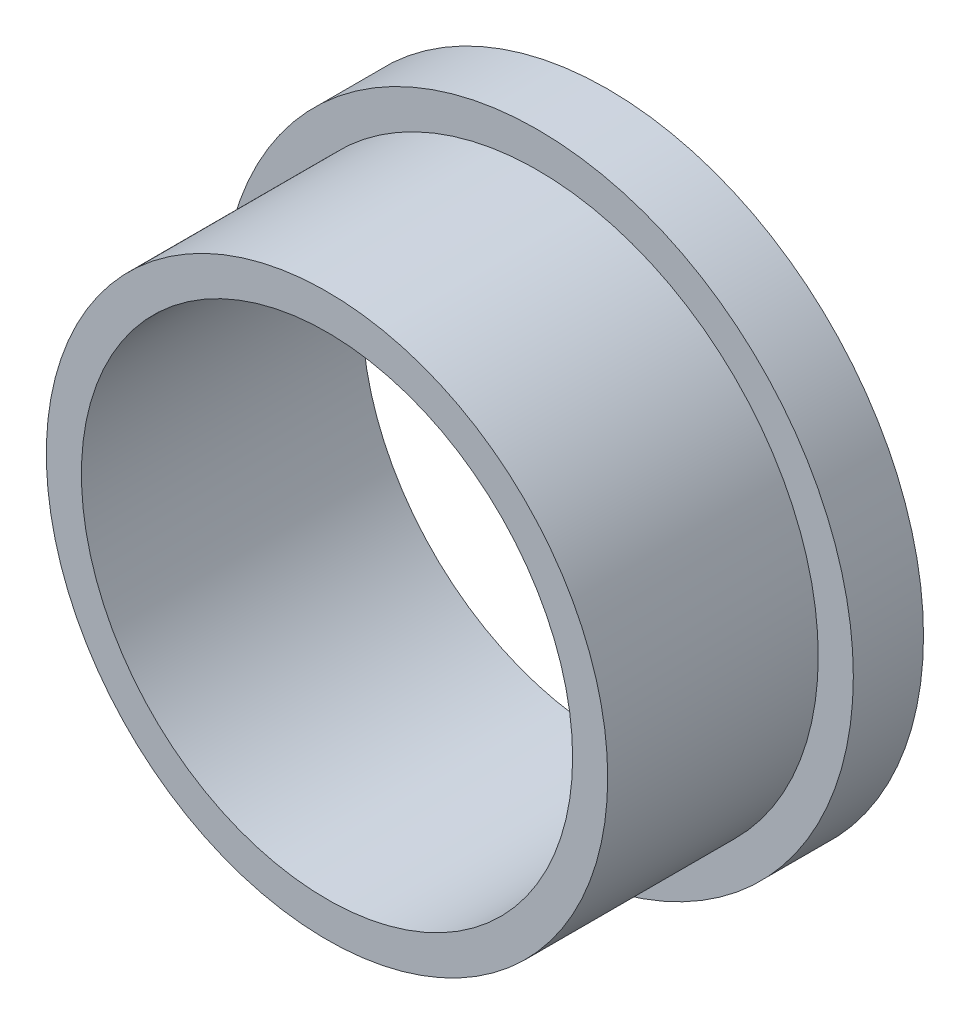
ISO-10303-21;
HEADER;
FILE_DESCRIPTION(('STEP AP214'),'2;1');
FILE_NAME('part.step','',(''),(''),'','','');
FILE_SCHEMA(('AUTOMOTIVE_DESIGN { 1 0 10303 214 1 1 1 1 }'));
ENDSEC;
DATA;
#1=APPLICATION_CONTEXT('core data for automotive mechanical design processes');
#2=APPLICATION_PROTOCOL_DEFINITION('international standard','automotive_design',2000,#1);
#3=PRODUCT_CONTEXT('',#1,'mechanical');
#4=PRODUCT('Part','Part','',(#3));
#5=PRODUCT_RELATED_PRODUCT_CATEGORY('part','',(#4));
#6=PRODUCT_DEFINITION_FORMATION('','',#4);
#7=PRODUCT_DEFINITION_CONTEXT('part definition',#1,'design');
#8=PRODUCT_DEFINITION('design','',#6,#7);
#9=PRODUCT_DEFINITION_SHAPE('','',#8);
#10=(LENGTH_UNIT() NAMED_UNIT(*) SI_UNIT(.MILLI.,.METRE.));
#11=(NAMED_UNIT(*) PLANE_ANGLE_UNIT() SI_UNIT($,.RADIAN.));
#12=(NAMED_UNIT(*) SI_UNIT($,.STERADIAN.) SOLID_ANGLE_UNIT());
#13=UNCERTAINTY_MEASURE_WITH_UNIT(LENGTH_MEASURE(1.E-05),#10,'distance_accuracy_value','');
#14=(GEOMETRIC_REPRESENTATION_CONTEXT(3) GLOBAL_UNCERTAINTY_ASSIGNED_CONTEXT((#13)) GLOBAL_UNIT_ASSIGNED_CONTEXT((#10,
#11,#12)) REPRESENTATION_CONTEXT('',''));
#15=CARTESIAN_POINT('',(0.,0.,0.));
#16=DIRECTION('',(0.,0.,1.));
#17=DIRECTION('',(1.,0.,0.));
#18=AXIS2_PLACEMENT_3D('',#15,#16,#17);
#19=CARTESIAN_POINT('',(0.,0.,1.));
#20=DIRECTION('',(0.,0.,1.));
#21=DIRECTION('',(1.,0.,0.));
#22=AXIS2_PLACEMENT_3D('',#19,#20,#21);
#23=PLANE('',#22);
#24=CARTESIAN_POINT('',(0.,0.,1.));
#25=DIRECTION('',(0.,0.,1.));
#26=DIRECTION('',(1.,0.,0.));
#27=AXIS2_PLACEMENT_3D('',#24,#25,#26);
#28=CIRCLE('',#27,4.5);
#29=CARTESIAN_POINT('',(4.5,0.,1.));
#30=VERTEX_POINT('',#29);
#31=EDGE_CURVE('E10',#30,#30,#28,.T.);
#32=ORIENTED_EDGE('',*,*,#31,.T.);
#33=EDGE_LOOP('',(#32));
#34=FACE_BOUND('',#33,.T.);
#35=CARTESIAN_POINT('',(0.,0.,1.));
#36=DIRECTION('',(0.,0.,1.));
#37=DIRECTION('',(1.,0.,0.));
#38=AXIS2_PLACEMENT_3D('',#35,#36,#37);
#39=CIRCLE('',#38,4.);
#40=CARTESIAN_POINT('',(4.,0.,1.));
#41=VERTEX_POINT('',#40);
#42=EDGE_CURVE('E40',#41,#41,#39,.T.);
#43=ORIENTED_EDGE('',*,*,#42,.F.);
#44=EDGE_LOOP('',(#43));
#45=FACE_BOUND('',#44,.T.);
#46=ADVANCED_FACE('F25',(#34,#45),#23,.T.);
#47=CARTESIAN_POINT('',(0.,0.,1.));
#48=DIRECTION('',(0.,0.,-1.));
#49=DIRECTION('',(-1.,0.,0.));
#50=AXIS2_PLACEMENT_3D('',#47,#48,#49);
#51=CYLINDRICAL_SURFACE('',#50,4.5);
#52=ORIENTED_EDGE('',*,*,#31,.F.);
#53=EDGE_LOOP('',(#52));
#54=FACE_BOUND('',#53,.T.);
#55=CARTESIAN_POINT('',(0.,0.,0.));
#56=DIRECTION('',(0.,0.,1.));
#57=DIRECTION('',(1.,0.,0.));
#58=AXIS2_PLACEMENT_3D('',#55,#56,#57);
#59=CIRCLE('',#58,4.5);
#60=CARTESIAN_POINT('',(4.5,0.,0.));
#61=VERTEX_POINT('',#60);
#62=EDGE_CURVE('E32',#61,#61,#59,.T.);
#63=ORIENTED_EDGE('',*,*,#62,.T.);
#64=EDGE_LOOP('',(#63));
#65=FACE_BOUND('',#64,.T.);
#66=ADVANCED_FACE('F27',(#54,#65),#51,.T.);
#67=CARTESIAN_POINT('',(0.,0.,0.));
#68=DIRECTION('',(0.,0.,1.));
#69=DIRECTION('',(1.,0.,0.));
#70=AXIS2_PLACEMENT_3D('',#67,#68,#69);
#71=PLANE('',#70);
#72=CARTESIAN_POINT('',(0.,0.,0.));
#73=DIRECTION('',(0.,0.,1.));
#74=DIRECTION('',(1.,0.,0.));
#75=AXIS2_PLACEMENT_3D('',#72,#73,#74);
#76=CIRCLE('',#75,3.5);
#77=CARTESIAN_POINT('',(3.5,0.,0.));
#78=VERTEX_POINT('',#77);
#79=EDGE_CURVE('E45',#78,#78,#76,.T.);
#80=ORIENTED_EDGE('',*,*,#79,.T.);
#81=EDGE_LOOP('',(#80));
#82=FACE_BOUND('',#81,.T.);
#83=ORIENTED_EDGE('',*,*,#62,.F.);
#84=EDGE_LOOP('',(#83));
#85=FACE_BOUND('',#84,.T.);
#86=ADVANCED_FACE('F63',(#82,#85),#71,.F.);
#87=CARTESIAN_POINT('',(0.,0.,4.));
#88=DIRECTION('',(0.,0.,-1.));
#89=DIRECTION('',(-1.,0.,0.));
#90=AXIS2_PLACEMENT_3D('',#87,#88,#89);
#91=CYLINDRICAL_SURFACE('',#90,4.);
#92=CARTESIAN_POINT('',(0.,0.,4.));
#93=DIRECTION('',(0.,0.,1.));
#94=DIRECTION('',(1.,0.,0.));
#95=AXIS2_PLACEMENT_3D('',#92,#93,#94);
#96=CIRCLE('',#95,4.);
#97=CARTESIAN_POINT('',(4.,0.,4.));
#98=VERTEX_POINT('',#97);
#99=EDGE_CURVE('E36',#98,#98,#96,.T.);
#100=ORIENTED_EDGE('',*,*,#99,.F.);
#101=EDGE_LOOP('',(#100));
#102=FACE_BOUND('',#101,.T.);
#103=ORIENTED_EDGE('',*,*,#42,.T.);
#104=EDGE_LOOP('',(#103));
#105=FACE_BOUND('',#104,.T.);
#106=ADVANCED_FACE('F57',(#102,#105),#91,.T.);
#107=CARTESIAN_POINT('',(0.,0.,4.));
#108=DIRECTION('',(0.,0.,1.));
#109=DIRECTION('',(1.,0.,0.));
#110=AXIS2_PLACEMENT_3D('',#107,#108,#109);
#111=PLANE('',#110);
#112=CARTESIAN_POINT('',(0.,0.,4.));
#113=DIRECTION('',(0.,0.,1.));
#114=DIRECTION('',(1.,0.,0.));
#115=AXIS2_PLACEMENT_3D('',#112,#113,#114);
#116=CIRCLE('',#115,3.5);
#117=CARTESIAN_POINT('',(3.5,0.,4.));
#118=VERTEX_POINT('',#117);
#119=EDGE_CURVE('E48',#118,#118,#116,.T.);
#120=ORIENTED_EDGE('',*,*,#119,.F.);
#121=EDGE_LOOP('',(#120));
#122=FACE_BOUND('',#121,.T.);
#123=ORIENTED_EDGE('',*,*,#99,.T.);
#124=EDGE_LOOP('',(#123));
#125=FACE_BOUND('',#124,.T.);
#126=ADVANCED_FACE('F54',(#122,#125),#111,.T.);
#127=CARTESIAN_POINT('',(0.,0.,0.));
#128=DIRECTION('',(0.,0.,1.));
#129=DIRECTION('',(1.,0.,0.));
#130=AXIS2_PLACEMENT_3D('',#127,#128,#129);
#131=CYLINDRICAL_SURFACE('',#130,3.5);
#132=ORIENTED_EDGE('',*,*,#79,.F.);
#133=EDGE_LOOP('',(#132));
#134=FACE_BOUND('',#133,.T.);
#135=ORIENTED_EDGE('',*,*,#119,.T.);
#136=EDGE_LOOP('',(#135));
#137=FACE_BOUND('',#136,.T.);
#138=ADVANCED_FACE('F52',(#134,#137),#131,.F.);
#139=CLOSED_SHELL('',(#46,#66,#86,#106,#126,#138));
#140=MANIFOLD_SOLID_BREP('B2',#139);
#141=ADVANCED_BREP_SHAPE_REPRESENTATION('',(#18,#140),#14);
#142=SHAPE_DEFINITION_REPRESENTATION(#9,#141);
ENDSEC;
END-ISO-10303-21;
